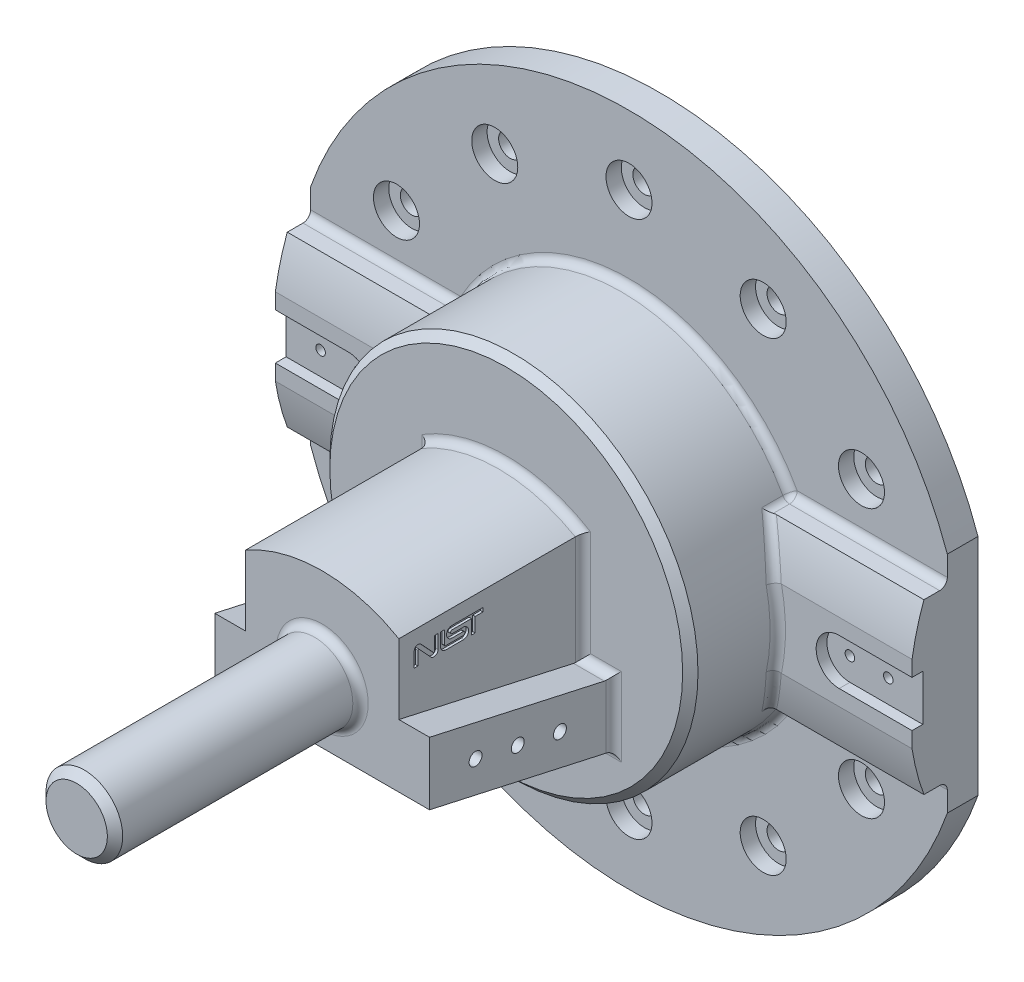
from build123d import *

# Parameters (mm, degrees)
BOSS_EXTRUDE1_DEPTH                                 = 25.4
SKETCH2_R                                           = 152.4
BOSS_EXTRUDE2_DEPTH                                 = 101.6
BOSS_EXTRUDE3_REACH                                 = 611.898
CUT_EXTRUDE1_DEPTH                                  = 8.89
F_3_8_16_TAPPED_HOLE1_D                             = 7.9375
F_3_8_16_TAPPED_HOLE1_DEPTH                         = 30.48
F_3_8_16_TAPPED_HOLE1_TIP                           = 2.384665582
CBORE_FOR_00_BINDING_HEAD_MACHINE_SCREW_D           = 19.05
CBORE_FOR_00_BINDING_HEAD_MACHINE_SCREW_CBORE_D     = 38.1
CBORE_FOR_00_BINDING_HEAD_MACHINE_SCREW_CBORE_DEPTH = 12.7
SKETCH9_R                                           = 127
CUT_EXTRUDE2_DEPTH                                  = 101.6
BOSS_EXTRUDE4_DEPTH                                 = 152.4
SKETCH11_R                                          = 31.75
BOSS_EXTRUDE5_DEPTH                                 = 203.2
DRAFT2_ANGLE                                        = 12.5
CUT_EXTRUDE3_DEPTH                                  = 25.4
F_1_2_13_TAPPED_HOLE1_AT_2_COUNT                    = 2
F_1_2_13_TAPPED_HOLE1_AT_2_PITCH                    = 35.772962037
F_1_2_13_TAPPED_HOLE1_AT_3_COUNT                    = 2
F_1_2_13_TAPPED_HOLE1_AT_3_PITCH                    = 71.545924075
CHAMFER1_SIZE                                       = 6.35
CHAMFER2_SIZE                                       = 9.525
FILLET1_R                                           = 6.35
CUT_EXTRUDE4_DEPTH                                  = 2.032


with BuildPart() as part:
    # Sketch1 → Boss-Extrude1 (new body)
    with BuildSketch(Plane.XY):
        with BuildLine():
            Line((-263.525, 92.838216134), (-263.525, -92.838216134))
            ThreePointArc((-263.525, -92.838216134), (0, -279.4), (263.525, -92.838216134))
            Line((263.525, -92.838216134), (263.525, 92.838216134))
            ThreePointArc((263.525, 92.838216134), (0, 279.4), (-263.525, 92.838216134))
        make_face()
    extrude(amount=BOSS_EXTRUDE1_DEPTH)

    # Sketch2 → Boss-Extrude2 (add)
    with BuildSketch(Plane.XY.offset(25.4)):
        Circle(SKETCH2_R)
    extrude(amount=BOSS_EXTRUDE2_DEPTH)

    # Boss-Extrude3: up to this face of the body (flat: up to its plane)
    boss_extrude3_end = Plane(part.part.faces().sort_by_distance((-263.525, 0, 12.7))[0])
    # Sketch3 → Boss-Extrude3 (add, up to the picked face)
    with BuildSketch(Plane(origin=(263.525, 0, 0), x_dir=(0, 0, -1), z_dir=(1, 0, 0)), mode=Mode.PRIVATE) as boss_extrude3_sk1:
        with BuildLine():
            Line((-44.767235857, 69.85), (-25.4, 69.85))
            Line((-25.4, 69.85), (-25.4, -69.85))
            Line((-25.4, -69.85), (-44.767235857, -69.85))
            ThreePointArc((-44.767235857, -69.85), (-50.600016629, -51.176273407), (-54.61, -32.028181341))
            Line((-54.61, -32.028181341), (-54.61, 32.028181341))
            ThreePointArc((-54.61, 32.028181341), (-50.600016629, 51.176273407), (-44.767235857, 69.85))
        make_face()
    boss_extrude3_tool1 = split(extrude(boss_extrude3_sk1.sketch, amount=-BOSS_EXTRUDE3_REACH, mode=Mode.PRIVATE), bisect_by=boss_extrude3_end, keep=Keep.BOTH, mode=Mode.PRIVATE)
    add(boss_extrude3_tool1.solids().sort_by(Axis((263.525, 0, 39.014359), (-1, 0, 0)))[0])

    # Sketch4 → Cut-Extrude1 (cut)
    with BuildSketch(Plane.XY.offset(54.61)):
        with BuildLine():
            Line((-280, 19.05), (-203.2, 19.05))
            ThreePointArc((-203.2, 19.05), (-184.15, 0), (-203.2, -19.05))
            Line((-203.2, -19.05), (-280, -19.05))
            Line((-280, -19.05), (-280, 19.05))
        make_face()
        with BuildLine():
            Line((203.2, -19.05), (280, -19.05))
            Line((280, -19.05), (280, 19.05))
            Line((280, 19.05), (203.2, 19.05))
            ThreePointArc((203.2, 19.05), (184.15, 0), (203.2, -19.05))
        make_face()
    extrude(amount=-CUT_EXTRUDE1_DEPTH, mode=Mode.SUBTRACT)

    # 3_8-16 Tapped Hole1
    with Locations(Plane.XY.offset(45.72)):
        with Locations((-234.95, 0), (-203.2, 0), (203.2, 0), (234.95, 0)):
            Hole(F_3_8_16_TAPPED_HOLE1_D / 2, depth=F_3_8_16_TAPPED_HOLE1_DEPTH)
            with Locations((0, 0, -(F_3_8_16_TAPPED_HOLE1_DEPTH + F_3_8_16_TAPPED_HOLE1_TIP / 2))):  # 118° drill point
                Cone(0, F_3_8_16_TAPPED_HOLE1_D / 2, F_3_8_16_TAPPED_HOLE1_TIP, mode=Mode.SUBTRACT)

    # CBORE for _00 Binding Head Machine Screw (through all)
    with Locations(Plane.XY.offset(25.4)):
        with Locations((-192.474145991, -111.125), (-111.112781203, -192.4812), (0, -222.25), (111.112781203, -192.4812), (192.474145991, -111.125), (192.474145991, 111.125), (111.112781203, 192.4812), (0, 222.25), (-111.112781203, 192.4812), (-192.474145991, 111.125)):
            CounterBoreHole(CBORE_FOR_00_BINDING_HEAD_MACHINE_SCREW_D / 2, CBORE_FOR_00_BINDING_HEAD_MACHINE_SCREW_CBORE_D / 2, CBORE_FOR_00_BINDING_HEAD_MACHINE_SCREW_CBORE_DEPTH)

    # Sketch9 → Cut-Extrude2 (cut)
    with BuildSketch(Plane(origin=(0, 0, 0), x_dir=(-1, 0, 0), z_dir=(0, 0, -1))):
        Circle(SKETCH9_R)
    extrude(amount=-CUT_EXTRUDE2_DEPTH, mode=Mode.SUBTRACT)

    # Sketch10 → Boss-Extrude4 (add)
    with BuildSketch(Plane.XY.offset(127)):
        with BuildLine():
            Line((-88.9, 39.896141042), (-88.9, -84.582))
            Line((-88.9, -84.582), (88.9, -84.582))
            Line((88.9, -84.582), (88.9, 39.896141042))
            ThreePointArc((88.9, 39.896141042), (0, 76.2), (-88.9, 39.896141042))
        make_face()
    extrude(amount=BOSS_EXTRUDE4_DEPTH)

    # Sketch11 → Boss-Extrude5 (add)
    with BuildSketch(Plane.XY.offset(279.4)):
        Circle(SKETCH11_R)
    extrude(amount=BOSS_EXTRUDE5_DEPTH)

    # Draft2
    draft2_faces = [part.faces().sort_by_distance(p)[0] for p in [
        (0, -84.582, 203.2),
    ]]
    draft(draft2_faces, Plane.XY.offset(127), DRAFT2_ANGLE)

    # Sketch12 → Cut-Extrude3 (cut)
    with BuildSketch(Plane(origin=(88.9, 0, 0), x_dir=(0, 0, -1), z_dir=(1, 0, 0))):
        Polygon((-313.30478001, 8.75417468), (-127, -32.548600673), (-127, 135.334512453), (-313.30478001, 135.334512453), align=None)
    cut_extrude3 = extrude(amount=-CUT_EXTRUDE3_DEPTH, mode=Mode.SUBTRACT)

    # Sketch13 → 1_2-13 Tapped Hole1 (revolve, cut)
    with BuildSketch(Plane(origin=(88.9, -48.710972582, 171.45), x_dir=(0, 0, -1), z_dir=(0, 1, 0))):
        Polygon((0, 0), (0, 33.699489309), (5.35813, 30.48), (5.35813, 0), align=None)
    f_1_2_13_tapped_hole1 = revolve(axis=Axis((95.25, -48.710972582, 171.45), (-1, 0, 0)), mode=Mode.SUBTRACT)

    # 1_2-13 Tapped Hole1 at 2: 1_2-13 Tapped Hole1 ×2
    with Locations(*[Vector(0, 0.2164396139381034, 0.9762960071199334) * (i * F_1_2_13_TAPPED_HOLE1_AT_2_PITCH) for i in range(1, F_1_2_13_TAPPED_HOLE1_AT_2_COUNT)]):
        add(f_1_2_13_tapped_hole1, mode=Mode.SUBTRACT)

    # 1_2-13 Tapped Hole1 at 3: 1_2-13 Tapped Hole1 ×2
    with Locations(*[Vector(0, 0.2164396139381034, 0.9762960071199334) * (i * F_1_2_13_TAPPED_HOLE1_AT_3_PITCH) for i in range(1, F_1_2_13_TAPPED_HOLE1_AT_3_COUNT)]):
        add(f_1_2_13_tapped_hole1, mode=Mode.SUBTRACT)

    # Mirror1: Cut-Extrude3, 1_2-13 Tapped Hole1 across plane
    add(cut_extrude3.mirror(Plane(origin=(0, 0, 0), x_dir=(0, 0, 1), z_dir=(1, 0, 0))), mode=Mode.SUBTRACT)
    add(f_1_2_13_tapped_hole1.mirror(Plane(origin=(0, 0, 0), x_dir=(0, 0, 1), z_dir=(1, 0, 0))), mode=Mode.SUBTRACT)

    # Mirror1 copy 1 sketch → Mirror1 copy 1 (revolve, cut)
    with BuildSketch(Plane(origin=(-88.9, -40.968286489, 206.375), x_dir=(0, 0, -1), z_dir=(0, 1, 0))):
        Polygon((0, 0), (0, -33.699489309), (5.35813, -30.48), (5.35813, 0), align=None)
    revolve(axis=Axis((-95.25, -40.968286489, 206.375), (-1, 0, 0)), mode=Mode.SUBTRACT)

    # Mirror1 copy 2 sketch → Mirror1 copy 2 (revolve, cut)
    with BuildSketch(Plane(origin=(-88.9, -33.225600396, 241.3), x_dir=(0, 0, -1), z_dir=(0, 1, 0))):
        Polygon((0, 0), (0, -33.699489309), (5.35813, -30.48), (5.35813, 0), align=None)
    revolve(axis=Axis((-95.25, -33.225600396, 241.3), (-1, 0, 0)), mode=Mode.SUBTRACT)

    # Chamfer1
    chamfer1_edges = [part.edges().sort_by_distance(p)[0] for p in [
        (-152.4, 0, 127),
        (-31.75, 0, 482.6),
    ]]
    chamfer(chamfer1_edges, length=CHAMFER1_SIZE)

    # Chamfer2
    chamfer2_edges = [part.edges().sort_by_distance(p)[0] for p in [
        (127, 0, 0),
    ]]
    chamfer(chamfer2_edges, length=CHAMFER2_SIZE)

    # Fillet1
    fillet1_edges = [part.edges().sort_by_distance(p)[0] for p in [
        (0, 152.4, 25.4),
        (0, -152.4, 25.4),
        (-135.450129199, 69.85, 35.083617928),
        (0, -84.582, 127),
        (88.9, -58.565300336, 127),
        (-143.40874707, 51.572194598, 50.49655622),
        (-152.4, 0, 54.61),
        (-143.408747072, -51.572194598, 50.496556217),
        (-31.75, 0, 279.4),
        (-135.450129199, -69.85, 35.083617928),
        (0, 76.2, 127),
        (135.450129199, 69.85, 35.083617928),
        (63.5, 13.318312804, 127),
        (143.408747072, 51.572194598, 50.496556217),
        (76.2, -32.548600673, 127),
        (151.546735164, 16.104255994, 54.61),
        (143.40874707, -51.572194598, 50.496556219),
        (135.450129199, -69.85, 35.083617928),
        (-88.9, -58.565300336, 127),
        (-76.2, -32.548600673, 127),
        (-63.5, 13.318312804, 127),
        (199.487564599, 69.85, 25.4),
        (-199.487564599, 69.85, 25.4),
        (-199.487564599, -69.85, 25.4),
        (199.487564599, -69.85, 25.4),
    ]]
    fillet(fillet1_edges, radius=FILLET1_R)

    # Sketch18 → Cut-Extrude4 (cut)
    with BuildSketch(Plane(origin=(63.5, 0, 0), x_dir=(0, 0, -1), z_dir=(1, 0, 0))):
        with BuildLine():
            Line((-244.9189015, 46.75), (-244.9189015, 35.945737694))
            ThreePointArc((-244.9189015, 35.945737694), (-243.689998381, 32.978903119), (-240.723163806, 31.75))
            Line((-240.723163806, 31.75), (-225.522677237, 31.75))
            ThreePointArc((-225.522677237, 31.75), (-221.67279416, 36.261464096), (-225.522677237, 40.772928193))
            Line((-225.522677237, 40.772928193), (-235.149438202, 40.772928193))
            ThreePointArc((-235.149438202, 40.772928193), (-236.55864201, 42.240845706), (-235.034455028, 43.588989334))
            Line((-235.034455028, 43.588989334), (-219.344384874, 43.588989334))
            Line((-219.344384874, 43.588989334), (-219.344384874, 31.75))
            Line((-219.344384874, 31.75), (-216.241892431, 31.75))
            Line((-216.241892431, 31.75), (-216.241892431, 43.588989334))
            Line((-216.241892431, 43.588989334), (-209.832607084, 43.588989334))
            Line((-209.832607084, 43.588989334), (-209.832607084, 46.75))
            Line((-209.832607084, 46.75), (-235.435869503, 46.75))
            ThreePointArc((-235.435869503, 46.75), (-239.979334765, 42.031192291), (-235.091946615, 37.66958022))
            Line((-235.091946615, 37.66958022), (-226.040101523, 37.66958022))
            ThreePointArc((-226.040101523, 37.66958022), (-224.746490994, 36.287198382), (-225.982609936, 34.853176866))
            Line((-225.982609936, 34.853176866), (-240.6940758, 34.853176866))
            ThreePointArc((-240.6940758, 34.853176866), (-241.46663297, 35.173180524), (-241.786636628, 35.945737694))
            Line((-241.786636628, 35.945737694), (-241.786636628, 46.75))
            Line((-241.786636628, 46.75), (-244.9189015, 46.75))
        make_face()
        with BuildLine():
            Line((-266.7, 31.75), (-266.7, 43.912091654))
            ThreePointArc((-266.7, 43.912091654), (-264.627827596, 46.948654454), (-261.044814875, 46.126078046))
            Line((-261.044814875, 46.126078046), (-250.779963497, 35.025651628))
            ThreePointArc((-250.779963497, 35.025651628), (-250.308341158, 34.92772605), (-250.062345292, 35.341855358))
            Line((-250.062345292, 35.341855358), (-250.062345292, 46.75))
            Line((-250.062345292, 46.75), (-246.93008042, 46.75))
            Line((-246.93008042, 46.75), (-246.93008042, 35.267141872))
            ThreePointArc((-246.93008042, 35.267141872), (-249.2826757, 31.948389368), (-253.193187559, 33.069424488))
            Line((-253.193187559, 33.069424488), (-262.660342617, 43.359022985))
            ThreePointArc((-262.660342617, 43.359022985), (-263.253816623, 43.496449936), (-263.597507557, 42.993484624))
            Line((-263.597507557, 42.993484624), (-263.597507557, 31.75))
            Line((-263.597507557, 31.75), (-266.7, 31.75))
        make_face()
    extrude(amount=-CUT_EXTRUDE4_DEPTH, mode=Mode.SUBTRACT)


solid = part.part
